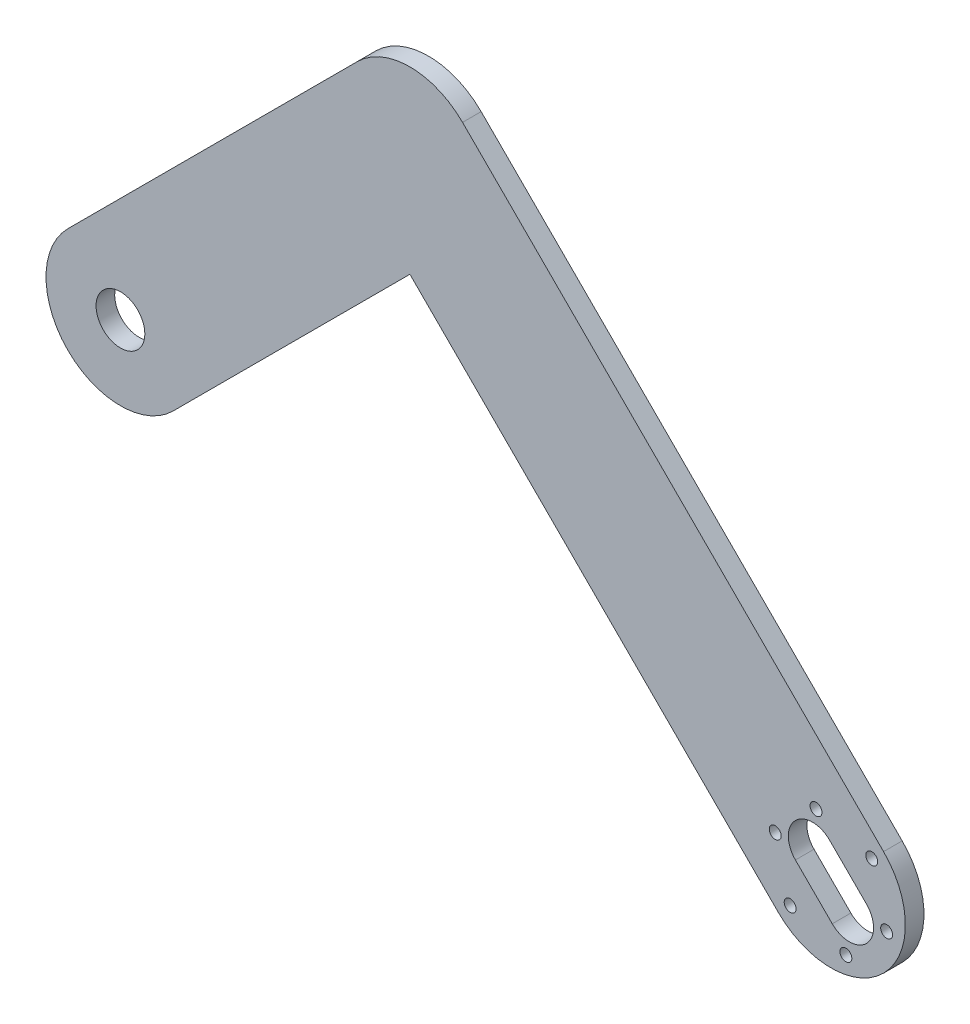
from build123d import *

# Parameters (mm, degrees)
EXTRUDE_1_DEPTH     = 5
CUT_EXTRUDE_1_DEPTH = 10
SKETCH_3_R          = 6.55
CUT_EXTRUDE_2_DEPTH = 6


with BuildPart() as part:
    # Sketch 1 → Extrude 1 (new body)
    with BuildSketch(Plane.XY):
        with BuildLine():
            Line((14.142135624, -14.142135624), (77.781745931, 49.497474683))
            Line((77.781745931, 49.497474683), (176.776695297, -49.497474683))
            ThreePointArc((176.776695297, -49.497474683), (205.060966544, -49.497474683), (205.060966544, -21.213203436))
            Line((205.060966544, -21.213203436), (91.923881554, 91.923881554))
            ThreePointArc((91.923881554, 91.923881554), (77.781745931, 97.781745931), (63.639610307, 91.923881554))
            Line((63.639610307, 91.923881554), (-14.142135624, 14.142135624))
            ThreePointArc((-14.142135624, 14.142135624), (-14.142135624, -14.142135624), (14.142135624, -14.142135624))
        make_face()
    extrude(amount=EXTRUDE_1_DEPTH)

    # Sketch 2 → Cut-Extrude 1 (cut)
    with BuildSketch(Plane.XY.offset(5)):
        with BuildLine():
            Line((190.56527753, -25.809397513), (200.464772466, -35.70889245))
            ThreePointArc((200.464772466, -35.70889245), (200.464772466, -44.901280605), (191.272384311, -44.901280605))
            Line((191.272384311, -44.901280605), (181.372889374, -35.001785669))
            ThreePointArc((181.372889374, -35.001785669), (181.372889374, -25.809397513), (190.56527753, -25.809397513))
        make_face()
        with BuildLine():
            ThreePointArc((174.815609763, -32.47501471), (177.078351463, -32.47501471), (177.078351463, -30.21227301))
            ThreePointArc((177.078351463, -30.21227301), (174.815609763, -30.21227301), (174.815609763, -32.47501471))
        make_face()
        with BuildLine():
            ThreePointArc((178.827304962, -47.446865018), (181.090046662, -47.446865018), (181.090046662, -45.184123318))
            ThreePointArc((181.090046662, -45.184123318), (178.827304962, -45.184123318), (178.827304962, -47.446865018))
        make_face()
        with BuildLine():
            ThreePointArc((193.79915527, -51.458560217), (196.061896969, -51.458560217), (196.061896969, -49.195818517))
            ThreePointArc((196.061896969, -49.195818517), (193.79915527, -49.195818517), (193.79915527, -51.458560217))
        make_face()
        with BuildLine():
            ThreePointArc((204.759310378, -40.498405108), (207.022052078, -40.498405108), (207.022052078, -38.235663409))
            ThreePointArc((207.022052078, -38.235663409), (204.759310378, -38.235663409), (204.759310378, -40.498405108))
        make_face()
        with BuildLine():
            ThreePointArc((200.747615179, -25.526554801), (203.010356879, -25.526554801), (203.010356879, -23.263813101))
            ThreePointArc((203.010356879, -23.263813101), (200.747615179, -23.263813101), (200.747615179, -25.526554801))
        make_face()
        with BuildLine():
            ThreePointArc((185.775764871, -21.514859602), (188.038506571, -21.514859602), (188.038506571, -19.252117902))
            ThreePointArc((188.038506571, -19.252117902), (185.775764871, -19.252117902), (185.775764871, -21.514859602))
        make_face()
    extrude(amount=-CUT_EXTRUDE_1_DEPTH, mode=Mode.SUBTRACT)

    # Sketch 3 → Cut-Extrude 2 (cut)
    with BuildSketch(Plane(origin=(0, 0, 0), x_dir=(-1, 0, 0), z_dir=(0, 0, -1))):
        Circle(SKETCH_3_R)
    extrude(amount=-CUT_EXTRUDE_2_DEPTH, mode=Mode.SUBTRACT)


solid = part.part
